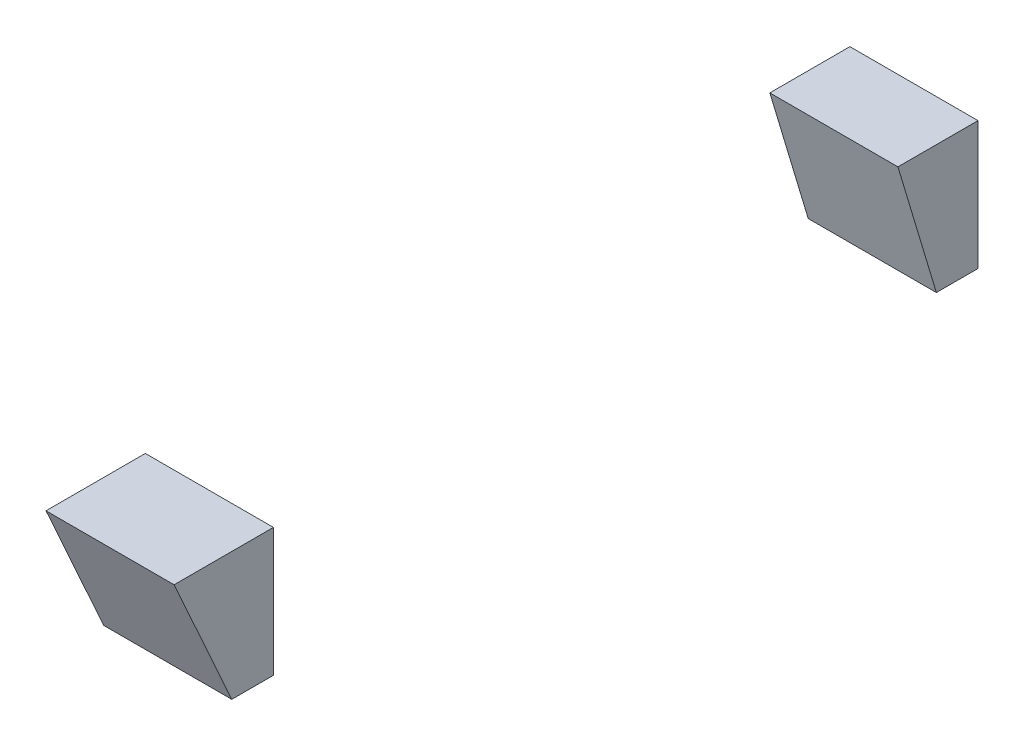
from build123d import *

# Parameters (mm, degrees)
SKETCH_1_W               = 4
SKETCH_1_H               = 4
EXTRUDE_1_DEPTH          = 5
EXTRUDE_1_2_DEPTH        = 5
CUT_EXTRUDE_1_DEPTH      = 30.495762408
CUT_EXTRUDE_1_DEPTH_BACK = 30.495762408
CUT_EXTRUDE_2_DEPTH      = 30.495762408
CUT_EXTRUDE_2_DEPTH_BACK = 30.495762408


with BuildPart() as part:
    # Sketch 1 → Extrude 1 (new body)
    with BuildSketch(Plane.XY):
        with Locations((-11, -11)):
            Rectangle(SKETCH_1_W, SKETCH_1_H)
    extrude(amount=EXTRUDE_1_DEPTH)

    # Sketch 2 → Cut-Extrude 1 (cut, two sides: drawn at the far end of the back side and taken through both)
    with BuildSketch(Plane.ZY.offset(13).offset(-CUT_EXTRUDE_1_DEPTH_BACK)):
        Polygon((-24.369333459, -70.011606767), (1.3, -13), (3.100990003, -9), (28.770323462, 48.011606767), (142.793536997, -3.327060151), (89.653880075, -121.350273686), align=None)
    extrude(amount=CUT_EXTRUDE_1_DEPTH + CUT_EXTRUDE_1_DEPTH_BACK, mode=Mode.SUBTRACT)


with BuildPart() as body_2:
    # Sketch 1 → Extrude 1 2 (new body)
    with BuildSketch(Plane.XY):
        with Locations((11, 11)):
            Rectangle(SKETCH_1_W, SKETCH_1_H)
    extrude(amount=EXTRUDE_1_2_DEPTH)

    # Sketch 3 → Cut-Extrude 2 (cut, two sides: drawn at the far end of the back side and taken through both)
    with BuildSketch(Plane(origin=(13, 0, 0), x_dir=(0, 0, -1), z_dir=(1, 0, 0)).offset(-CUT_EXTRUDE_2_DEPTH_BACK)):
        Polygon((-20.384483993, 72.614946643), (-2.5, 13), (-1.3, 9), (16.584483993, -50.614946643), (-102.645409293, -86.383914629), (-139.614377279, 36.845978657), align=None)
    extrude(amount=CUT_EXTRUDE_2_DEPTH + CUT_EXTRUDE_2_DEPTH_BACK, mode=Mode.SUBTRACT)


solid = Compound([part.part, body_2.part])
